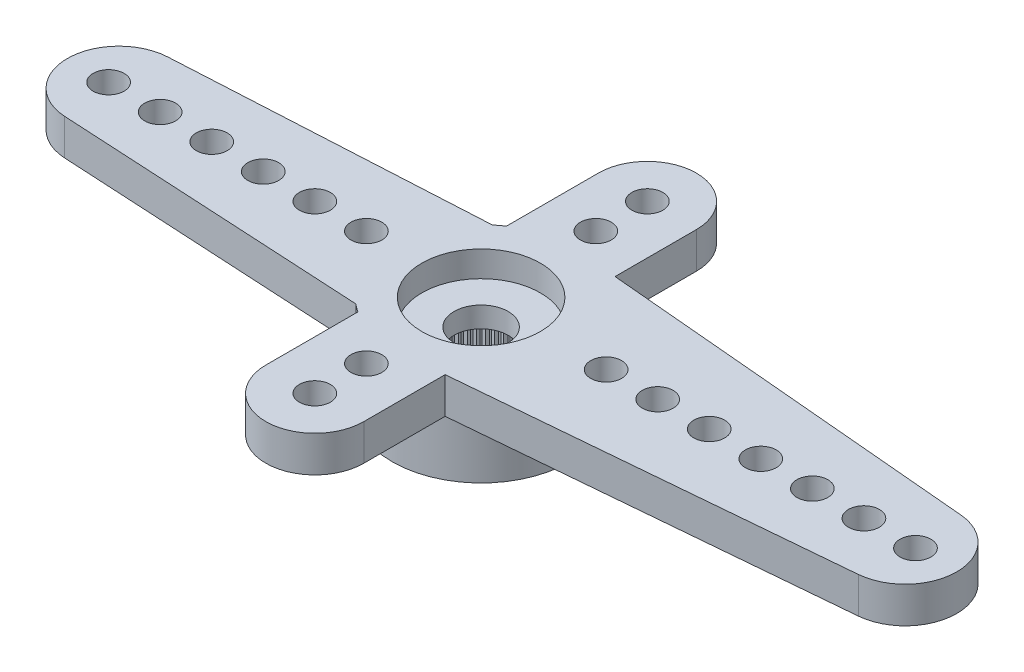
from build123d import *

# Parameters (mm, degrees)
RESSALTO_EXTRUS_O1_DEPTH = 1.4
ESBO_O2_R                = 3.45
RESSALTO_EXTRUS_O2_DEPTH = 2.4
FURO1_D                  = 1.2
PADR_O_LINEAR1_COUNT     = 6
PADR_O_LINEAR1_PITCH     = 2
RESSALTO_EXTRUS_O3_DEPTH = 1.4
FURO2_D                  = 1.2
PADR_O_LINEAR2_COUNT     = 7
PADR_O_LINEAR2_PITCH     = 2
RESSALTO_EXTRUS_O4_DEPTH = 1.4
FURO3_D                  = 1.2
PADR_O_LINEAR3_COUNT     = 2
PADR_O_LINEAR3_PITCH     = 2
PADR_OCIRCULAR1_COUNT    = 2
PADR_OCIRCULAR1_COPY_1_D = 1.2
FURO4_D                  = 4.95
FURO4_DEPTH              = 2
FURO5_D                  = 4.6
FURO5_DEPTH              = 1
FURO6_D                  = 2.1
RESSALTO_EXTRUS_O5_START = -2
RESSALTO_EXTRUS_O5_DEPTH = 2
PADR_OCIRCULAR2_COUNT    = 60


with BuildPart() as part:
    # Esbo_o1 → Ressalto-extrus_o1 (new body)
    with BuildSketch(Plane(origin=(0, 0, 0), x_dir=(1, 0, 0), z_dir=(0, 1, 0))):
        with BuildLine():
            Line((-14.159121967, 1.99702088), (-2.209072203, 2.65))
            ThreePointArc((-2.209072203, 2.65), (3.45, 0), (-2.209072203, -2.65))
            Line((-2.209072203, -2.65), (-14.159121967, -1.99702088))
            ThreePointArc((-14.159121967, -1.99702088), (-16.05, 0), (-14.159121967, 1.99702088))
        make_face()
    extrude(amount=-RESSALTO_EXTRUS_O1_DEPTH)

    # Esbo_o2 → Ressalto-extrus_o2 (add)
    with BuildSketch(Plane.XZ.offset(1.4)):
        with Locations(Location((0, 0, 0), (0, 0, 90))):
            Circle(ESBO_O2_R)
    extrude(amount=RESSALTO_EXTRUS_O2_DEPTH)

    # Furo1 (through all)
    with Locations(Plane(origin=(0, 0, 0), x_dir=(1, 0, 0), z_dir=(0, 1, 0))):
        with Locations((-14.45, 0)):
            furo1 = Hole(FURO1_D / 2)

    # Padr_o linear1: Furo1 ×6
    with Locations(*[(i * PADR_O_LINEAR1_PITCH, 0, 0) for i in range(1, PADR_O_LINEAR1_COUNT)]):
        add(furo1, mode=Mode.SUBTRACT)

    # Esbo_o12 → Ressalto-extrus_o3 (add)
    with BuildSketch(Plane(origin=(0, 0, 0), x_dir=(1, 0, 0), z_dir=(0, 1, 0))):
        with BuildLine():
            Line((0.304103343, 3.436571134), (16.626291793, 1.99221515))
            ThreePointArc((16.626291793, 1.99221515), (18.45, 0), (16.626291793, -1.99221515))
            Line((16.626291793, -1.99221515), (0.304103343, -3.436571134))
            ThreePointArc((0.304103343, -3.436571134), (3.45, 0), (0.304103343, 3.436571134))
        make_face()
    extrude(amount=-RESSALTO_EXTRUS_O3_DEPTH)

    # Furo2 (through all)
    with Locations(Plane(origin=(0, 0, 0), x_dir=(1, 0, 0), z_dir=(0, 1, 0))):
        with Locations((16.85, 0)):
            furo2 = Hole(FURO2_D / 2)

    # Padr_o linear2: Furo2 ×7
    with Locations(*[(-i * PADR_O_LINEAR2_PITCH, 0, 0) for i in range(1, PADR_O_LINEAR2_COUNT)]):
        add(furo2, mode=Mode.SUBTRACT)

    # Esbo_o16 → Ressalto-extrus_o4 (add)
    with BuildSketch(Plane(origin=(0, 0, 0), x_dir=(1, 0, 0), z_dir=(0, 1, 0))):
        with BuildLine():
            Line((-1.9, -6.45), (-1.9, 6.45))
            ThreePointArc((-1.9, 6.45), (0, 8.35), (1.9, 6.45))
            Line((1.9, 6.45), (1.9, -6.45))
            ThreePointArc((1.9, -6.45), (0, -8.35), (-1.9, -6.45))
        make_face()
    extrude(amount=-RESSALTO_EXTRUS_O4_DEPTH)

    # Furo3 (through all)
    with Locations(Plane(origin=(0, 0, 0), x_dir=(1, 0, 0), z_dir=(0, 1, 0))):
        with Locations((0, -6.45)):
            furo3 = Hole(FURO3_D / 2)

    # Padr_o linear3: Furo3 ×2
    with Locations(*[(0, 0, -i * PADR_O_LINEAR3_PITCH) for i in range(1, PADR_O_LINEAR3_COUNT)]):
        add(furo3, mode=Mode.SUBTRACT)

    # Padr_oCircular1: Furo3 ×2 about axis
    padr_ocircular1_axis = Axis((0, 0, 0), (0, 1, 0))
    for i in range(1, PADR_OCIRCULAR1_COUNT):
        add(furo3.rotate(padr_ocircular1_axis, i * 360 / PADR_OCIRCULAR1_COUNT), mode=Mode.SUBTRACT)

    # Padr_oCircular1 copy 1 (through all)
    with Locations(Plane(origin=(0, 0, 2), x_dir=(-1, 0, 0), z_dir=(0, 1, 0))):
        with Locations((0, -6.45)):
            Hole(PADR_OCIRCULAR1_COPY_1_D / 2)

    # Furo4
    with Locations(Plane(origin=(0, -3.8, 0), x_dir=(-1, 0, 0), z_dir=(0, -1, 0))):
        with Locations((0, 0)):
            Hole(FURO4_D / 2, depth=FURO4_DEPTH)

    # Furo5
    with Locations(Plane(origin=(0, 0, 0), x_dir=(1, 0, 0), z_dir=(0, 1, 0))):
        with Locations((0, 0)):
            Hole(FURO5_D / 2, depth=FURO5_DEPTH)

    # Furo6 (through all)
    with Locations(Plane(origin=(0, 0, 0), x_dir=(1, 0, 0), z_dir=(0, 1, 0))):
        with Locations((0, 0)):
            Hole(FURO6_D / 2)

    # Esbo_o11 → Ressalto-extrus_o5 (add)
    with BuildSketch(Plane.XZ.offset(3.8).offset(RESSALTO_EXTRUS_O5_START)):
        with BuildLine():
            Line((-0.098056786, 2.473056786), (0, 2.375))
            Line((0, 2.375), (0.098056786, 2.473056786))
            ThreePointArc((0.098056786, 2.473056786), (0, 2.475), (-0.098056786, 2.473056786))
        make_face()
    ressalto_extrus_o5 = extrude(amount=RESSALTO_EXTRUS_O5_DEPTH)

    # Padr_oCircular2: Ressalto-extrus_o5 ×60 about axis
    padr_ocircular2_axis = Axis((0, 0, 0), (0, 1, 0))
    for i in range(1, PADR_OCIRCULAR2_COUNT):
        add(ressalto_extrus_o5.rotate(padr_ocircular2_axis, i * 360 / PADR_OCIRCULAR2_COUNT))


solid = part.part
